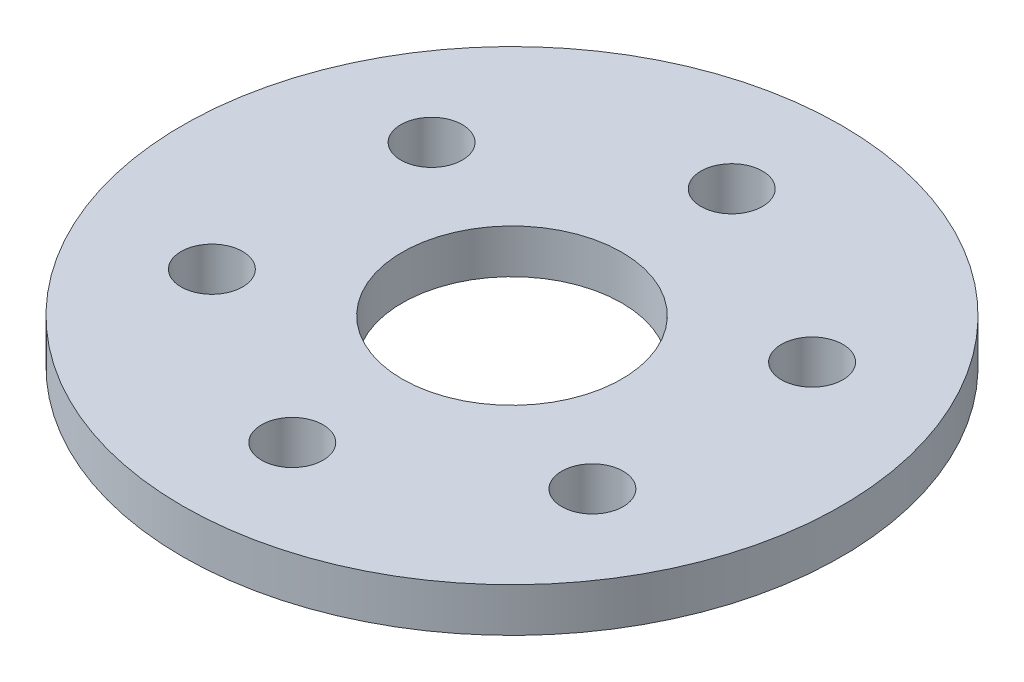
ISO-10303-21;
HEADER;
FILE_DESCRIPTION(('STEP AP214'),'2;1');
FILE_NAME('part.step','',(''),(''),'','','');
FILE_SCHEMA(('AUTOMOTIVE_DESIGN { 1 0 10303 214 1 1 1 1 }'));
ENDSEC;
DATA;
#1=APPLICATION_CONTEXT('core data for automotive mechanical design processes');
#2=APPLICATION_PROTOCOL_DEFINITION('international standard','automotive_design',2000,#1);
#3=PRODUCT_CONTEXT('',#1,'mechanical');
#4=PRODUCT('Part','Part','',(#3));
#5=PRODUCT_RELATED_PRODUCT_CATEGORY('part','',(#4));
#6=PRODUCT_DEFINITION_FORMATION('','',#4);
#7=PRODUCT_DEFINITION_CONTEXT('part definition',#1,'design');
#8=PRODUCT_DEFINITION('design','',#6,#7);
#9=PRODUCT_DEFINITION_SHAPE('','',#8);
#10=(LENGTH_UNIT() NAMED_UNIT(*) SI_UNIT(.MILLI.,.METRE.));
#11=(NAMED_UNIT(*) PLANE_ANGLE_UNIT() SI_UNIT($,.RADIAN.));
#12=(NAMED_UNIT(*) SI_UNIT($,.STERADIAN.) SOLID_ANGLE_UNIT());
#13=UNCERTAINTY_MEASURE_WITH_UNIT(LENGTH_MEASURE(1.E-05),#10,'distance_accuracy_value','');
#14=(GEOMETRIC_REPRESENTATION_CONTEXT(3) GLOBAL_UNCERTAINTY_ASSIGNED_CONTEXT((#13)) GLOBAL_UNIT_ASSIGNED_CONTEXT((#10,
#11,#12)) REPRESENTATION_CONTEXT('',''));
#15=CARTESIAN_POINT('',(0.,0.,0.));
#16=DIRECTION('',(0.,0.,1.));
#17=DIRECTION('',(1.,0.,0.));
#18=AXIS2_PLACEMENT_3D('',#15,#16,#17);
#19=CARTESIAN_POINT('',(0.,5.,0.));
#20=DIRECTION('',(0.,1.,0.));
#21=DIRECTION('',(0.,0.,1.));
#22=AXIS2_PLACEMENT_3D('',#19,#20,#21);
#23=PLANE('',#22);
#24=CARTESIAN_POINT('',(21.6506350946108,5.,12.5000000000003));
#25=DIRECTION('',(0.,1.,0.));
#26=DIRECTION('',(0.,0.,1.));
#27=AXIS2_PLACEMENT_3D('',#24,#25,#26);
#28=CIRCLE('',#27,3.5);
#29=CARTESIAN_POINT('',(21.6506350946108,5.,16.0000000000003));
#30=VERTEX_POINT('',#29);
#31=EDGE_CURVE('E84',#30,#30,#28,.T.);
#32=ORIENTED_EDGE('',*,*,#31,.F.);
#33=EDGE_LOOP('',(#32));
#34=FACE_BOUND('',#33,.T.);
#35=CARTESIAN_POINT('',(21.6506350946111,5.,-12.4999999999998));
#36=DIRECTION('',(0.,1.,0.));
#37=DIRECTION('',(0.,0.,1.));
#38=AXIS2_PLACEMENT_3D('',#35,#36,#37);
#39=CIRCLE('',#38,3.5);
#40=CARTESIAN_POINT('',(21.6506350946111,5.,-8.9999999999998));
#41=VERTEX_POINT('',#40);
#42=EDGE_CURVE('E78',#41,#41,#39,.T.);
#43=ORIENTED_EDGE('',*,*,#42,.F.);
#44=EDGE_LOOP('',(#43));
#45=FACE_BOUND('',#44,.T.);
#46=CARTESIAN_POINT('',(1.74574168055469E-13,5.,-25.));
#47=DIRECTION('',(0.,1.,0.));
#48=DIRECTION('',(0.,0.,1.));
#49=AXIS2_PLACEMENT_3D('',#46,#47,#48);
#50=CIRCLE('',#49,3.5);
#51=CARTESIAN_POINT('',(1.74574168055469E-13,5.,-21.5));
#52=VERTEX_POINT('',#51);
#53=EDGE_CURVE('E72',#52,#52,#50,.T.);
#54=ORIENTED_EDGE('',*,*,#53,.F.);
#55=EDGE_LOOP('',(#54));
#56=FACE_BOUND('',#55,.T.);
#57=CARTESIAN_POINT('',(-21.6506350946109,5.,-12.5000000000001));
#58=DIRECTION('',(0.,1.,0.));
#59=DIRECTION('',(0.,0.,1.));
#60=AXIS2_PLACEMENT_3D('',#57,#58,#59);
#61=CIRCLE('',#60,3.5);
#62=CARTESIAN_POINT('',(-21.6506350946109,5.,-9.0000000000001));
#63=VERTEX_POINT('',#62);
#64=EDGE_CURVE('E66',#63,#63,#61,.T.);
#65=ORIENTED_EDGE('',*,*,#64,.F.);
#66=EDGE_LOOP('',(#65));
#67=FACE_BOUND('',#66,.T.);
#68=CARTESIAN_POINT('',(-21.650635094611,5.,12.5));
#69=DIRECTION('',(0.,1.,0.));
#70=DIRECTION('',(0.,0.,1.));
#71=AXIS2_PLACEMENT_3D('',#68,#69,#70);
#72=CIRCLE('',#71,3.5);
#73=CARTESIAN_POINT('',(-21.650635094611,5.,16.));
#74=VERTEX_POINT('',#73);
#75=EDGE_CURVE('E60',#74,#74,#72,.T.);
#76=ORIENTED_EDGE('',*,*,#75,.F.);
#77=EDGE_LOOP('',(#76));
#78=FACE_BOUND('',#77,.T.);
#79=CARTESIAN_POINT('',(0.,5.,25.));
#80=DIRECTION('',(0.,1.,0.));
#81=DIRECTION('',(0.,0.,1.));
#82=AXIS2_PLACEMENT_3D('',#79,#80,#81);
#83=CIRCLE('',#82,3.5);
#84=CARTESIAN_POINT('',(0.,5.,28.5));
#85=VERTEX_POINT('',#84);
#86=EDGE_CURVE('E54',#85,#85,#83,.T.);
#87=ORIENTED_EDGE('',*,*,#86,.F.);
#88=EDGE_LOOP('',(#87));
#89=FACE_BOUND('',#88,.T.);
#90=CARTESIAN_POINT('',(0.,5.,0.));
#91=DIRECTION('',(0.,1.,0.));
#92=DIRECTION('',(0.,0.,1.));
#93=AXIS2_PLACEMENT_3D('',#90,#91,#92);
#94=CIRCLE('',#93,37.5);
#95=CARTESIAN_POINT('',(0.,5.,37.5));
#96=VERTEX_POINT('',#95);
#97=EDGE_CURVE('E10',#96,#96,#94,.T.);
#98=ORIENTED_EDGE('',*,*,#97,.T.);
#99=EDGE_LOOP('',(#98));
#100=FACE_BOUND('',#99,.T.);
#101=CARTESIAN_POINT('',(0.,5.,0.));
#102=DIRECTION('',(0.,1.,0.));
#103=DIRECTION('',(0.,0.,1.));
#104=AXIS2_PLACEMENT_3D('',#101,#102,#103);
#105=CIRCLE('',#104,12.5);
#106=CARTESIAN_POINT('',(0.,5.,12.5));
#107=VERTEX_POINT('',#106);
#108=EDGE_CURVE('E42',#107,#107,#105,.T.);
#109=ORIENTED_EDGE('',*,*,#108,.F.);
#110=EDGE_LOOP('',(#109));
#111=FACE_BOUND('',#110,.T.);
#112=ADVANCED_FACE('F31',(#34,#45,#56,#67,#78,#89,#100,#111),#23,.T.);
#113=CARTESIAN_POINT('',(0.,0.,0.));
#114=DIRECTION('',(0.,1.,0.));
#115=DIRECTION('',(0.,0.,1.));
#116=AXIS2_PLACEMENT_3D('',#113,#114,#115);
#117=PLANE('',#116);
#118=CARTESIAN_POINT('',(21.6506350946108,0.,12.5000000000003));
#119=DIRECTION('',(0.,1.,0.));
#120=DIRECTION('',(0.,0.,1.));
#121=AXIS2_PLACEMENT_3D('',#118,#119,#120);
#122=CIRCLE('',#121,3.5);
#123=CARTESIAN_POINT('',(21.6506350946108,0.,16.0000000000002));
#124=VERTEX_POINT('',#123);
#125=EDGE_CURVE('E81',#124,#124,#122,.T.);
#126=ORIENTED_EDGE('',*,*,#125,.T.);
#127=EDGE_LOOP('',(#126));
#128=FACE_BOUND('',#127,.T.);
#129=CARTESIAN_POINT('',(21.6506350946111,0.,-12.4999999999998));
#130=DIRECTION('',(0.,1.,0.));
#131=DIRECTION('',(0.,0.,1.));
#132=AXIS2_PLACEMENT_3D('',#129,#130,#131);
#133=CIRCLE('',#132,3.5);
#134=CARTESIAN_POINT('',(21.6506350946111,0.,-8.9999999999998));
#135=VERTEX_POINT('',#134);
#136=EDGE_CURVE('E75',#135,#135,#133,.T.);
#137=ORIENTED_EDGE('',*,*,#136,.T.);
#138=EDGE_LOOP('',(#137));
#139=FACE_BOUND('',#138,.T.);
#140=CARTESIAN_POINT('',(1.74574168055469E-13,0.,-25.));
#141=DIRECTION('',(0.,1.,0.));
#142=DIRECTION('',(0.,0.,1.));
#143=AXIS2_PLACEMENT_3D('',#140,#141,#142);
#144=CIRCLE('',#143,3.49999999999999);
#145=CARTESIAN_POINT('',(1.74574168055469E-13,0.,-21.5));
#146=VERTEX_POINT('',#145);
#147=EDGE_CURVE('E69',#146,#146,#144,.T.);
#148=ORIENTED_EDGE('',*,*,#147,.T.);
#149=EDGE_LOOP('',(#148));
#150=FACE_BOUND('',#149,.T.);
#151=CARTESIAN_POINT('',(-21.6506350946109,0.,-12.5000000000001));
#152=DIRECTION('',(0.,1.,0.));
#153=DIRECTION('',(0.,0.,1.));
#154=AXIS2_PLACEMENT_3D('',#151,#152,#153);
#155=CIRCLE('',#154,3.5);
#156=CARTESIAN_POINT('',(-21.6506350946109,0.,-9.00000000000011));
#157=VERTEX_POINT('',#156);
#158=EDGE_CURVE('E63',#157,#157,#155,.T.);
#159=ORIENTED_EDGE('',*,*,#158,.T.);
#160=EDGE_LOOP('',(#159));
#161=FACE_BOUND('',#160,.T.);
#162=CARTESIAN_POINT('',(-21.650635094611,0.,12.5));
#163=DIRECTION('',(0.,1.,0.));
#164=DIRECTION('',(0.,0.,1.));
#165=AXIS2_PLACEMENT_3D('',#162,#163,#164);
#166=CIRCLE('',#165,3.5);
#167=CARTESIAN_POINT('',(-21.650635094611,0.,15.9999999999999));
#168=VERTEX_POINT('',#167);
#169=EDGE_CURVE('E57',#168,#168,#166,.T.);
#170=ORIENTED_EDGE('',*,*,#169,.T.);
#171=EDGE_LOOP('',(#170));
#172=FACE_BOUND('',#171,.T.);
#173=CARTESIAN_POINT('',(0.,0.,25.));
#174=DIRECTION('',(0.,1.,0.));
#175=DIRECTION('',(0.,0.,1.));
#176=AXIS2_PLACEMENT_3D('',#173,#174,#175);
#177=CIRCLE('',#176,3.49999999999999);
#178=CARTESIAN_POINT('',(0.,0.,28.5));
#179=VERTEX_POINT('',#178);
#180=EDGE_CURVE('E51',#179,#179,#177,.T.);
#181=ORIENTED_EDGE('',*,*,#180,.T.);
#182=EDGE_LOOP('',(#181));
#183=FACE_BOUND('',#182,.T.);
#184=CARTESIAN_POINT('',(0.,0.,0.));
#185=DIRECTION('',(0.,1.,0.));
#186=DIRECTION('',(0.,0.,1.));
#187=AXIS2_PLACEMENT_3D('',#184,#185,#186);
#188=CIRCLE('',#187,37.5);
#189=CARTESIAN_POINT('',(0.,0.,37.5));
#190=VERTEX_POINT('',#189);
#191=EDGE_CURVE('E38',#190,#190,#188,.T.);
#192=ORIENTED_EDGE('',*,*,#191,.F.);
#193=EDGE_LOOP('',(#192));
#194=FACE_BOUND('',#193,.T.);
#195=CARTESIAN_POINT('',(0.,0.,0.));
#196=DIRECTION('',(0.,1.,0.));
#197=DIRECTION('',(0.,0.,1.));
#198=AXIS2_PLACEMENT_3D('',#195,#196,#197);
#199=CIRCLE('',#198,12.5);
#200=CARTESIAN_POINT('',(0.,0.,12.5));
#201=VERTEX_POINT('',#200);
#202=EDGE_CURVE('E46',#201,#201,#199,.T.);
#203=ORIENTED_EDGE('',*,*,#202,.T.);
#204=EDGE_LOOP('',(#203));
#205=FACE_BOUND('',#204,.T.);
#206=ADVANCED_FACE('F92',(#128,#139,#150,#161,#172,#183,#194,#205),#117,.F.);
#207=CARTESIAN_POINT('',(0.,5.,0.));
#208=DIRECTION('',(0.,-1.,0.));
#209=DIRECTION('',(0.,0.,-1.));
#210=AXIS2_PLACEMENT_3D('',#207,#208,#209);
#211=CYLINDRICAL_SURFACE('',#210,37.5);
#212=ORIENTED_EDGE('',*,*,#97,.F.);
#213=EDGE_LOOP('',(#212));
#214=FACE_BOUND('',#213,.T.);
#215=ORIENTED_EDGE('',*,*,#191,.T.);
#216=EDGE_LOOP('',(#215));
#217=FACE_BOUND('',#216,.T.);
#218=ADVANCED_FACE('F33',(#214,#217),#211,.T.);
#219=CARTESIAN_POINT('',(0.,5.,0.));
#220=DIRECTION('',(0.,-1.,0.));
#221=DIRECTION('',(0.,0.,-1.));
#222=AXIS2_PLACEMENT_3D('',#219,#220,#221);
#223=CYLINDRICAL_SURFACE('',#222,12.5);
#224=ORIENTED_EDGE('',*,*,#108,.T.);
#225=EDGE_LOOP('',(#224));
#226=FACE_BOUND('',#225,.T.);
#227=ORIENTED_EDGE('',*,*,#202,.F.);
#228=EDGE_LOOP('',(#227));
#229=FACE_BOUND('',#228,.T.);
#230=ADVANCED_FACE('F105',(#226,#229),#223,.F.);
#231=CARTESIAN_POINT('',(0.,5.,25.));
#232=DIRECTION('',(0.,1.,0.));
#233=DIRECTION('',(0.,0.,1.));
#234=AXIS2_PLACEMENT_3D('',#231,#232,#233);
#235=CYLINDRICAL_SURFACE('',#234,3.5);
#236=ORIENTED_EDGE('',*,*,#180,.F.);
#237=EDGE_LOOP('',(#236));
#238=FACE_BOUND('',#237,.T.);
#239=ORIENTED_EDGE('',*,*,#86,.T.);
#240=EDGE_LOOP('',(#239));
#241=FACE_BOUND('',#240,.T.);
#242=ADVANCED_FACE('F108',(#238,#241),#235,.F.);
#243=CARTESIAN_POINT('',(-21.650635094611,5.,12.5));
#244=DIRECTION('',(0.,1.,0.));
#245=DIRECTION('',(0.,0.,1.));
#246=AXIS2_PLACEMENT_3D('',#243,#244,#245);
#247=CYLINDRICAL_SURFACE('',#246,3.5);
#248=ORIENTED_EDGE('',*,*,#169,.F.);
#249=EDGE_LOOP('',(#248));
#250=FACE_BOUND('',#249,.T.);
#251=ORIENTED_EDGE('',*,*,#75,.T.);
#252=EDGE_LOOP('',(#251));
#253=FACE_BOUND('',#252,.T.);
#254=ADVANCED_FACE('F123',(#250,#253),#247,.F.);
#255=CARTESIAN_POINT('',(-21.6506350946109,5.,-12.5000000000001));
#256=DIRECTION('',(0.,1.,0.));
#257=DIRECTION('',(0.,0.,1.));
#258=AXIS2_PLACEMENT_3D('',#255,#256,#257);
#259=CYLINDRICAL_SURFACE('',#258,3.5);
#260=ORIENTED_EDGE('',*,*,#158,.F.);
#261=EDGE_LOOP('',(#260));
#262=FACE_BOUND('',#261,.T.);
#263=ORIENTED_EDGE('',*,*,#64,.T.);
#264=EDGE_LOOP('',(#263));
#265=FACE_BOUND('',#264,.T.);
#266=ADVANCED_FACE('F127',(#262,#265),#259,.F.);
#267=CARTESIAN_POINT('',(1.74574168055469E-13,5.,-25.));
#268=DIRECTION('',(0.,1.,0.));
#269=DIRECTION('',(0.,0.,1.));
#270=AXIS2_PLACEMENT_3D('',#267,#268,#269);
#271=CYLINDRICAL_SURFACE('',#270,3.5);
#272=ORIENTED_EDGE('',*,*,#147,.F.);
#273=EDGE_LOOP('',(#272));
#274=FACE_BOUND('',#273,.T.);
#275=ORIENTED_EDGE('',*,*,#53,.T.);
#276=EDGE_LOOP('',(#275));
#277=FACE_BOUND('',#276,.T.);
#278=ADVANCED_FACE('F131',(#274,#277),#271,.F.);
#279=CARTESIAN_POINT('',(21.6506350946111,5.,-12.4999999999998));
#280=DIRECTION('',(0.,1.,0.));
#281=DIRECTION('',(0.,0.,1.));
#282=AXIS2_PLACEMENT_3D('',#279,#280,#281);
#283=CYLINDRICAL_SURFACE('',#282,3.5);
#284=ORIENTED_EDGE('',*,*,#136,.F.);
#285=EDGE_LOOP('',(#284));
#286=FACE_BOUND('',#285,.T.);
#287=ORIENTED_EDGE('',*,*,#42,.T.);
#288=EDGE_LOOP('',(#287));
#289=FACE_BOUND('',#288,.T.);
#290=ADVANCED_FACE('F135',(#286,#289),#283,.F.);
#291=CARTESIAN_POINT('',(21.6506350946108,5.,12.5000000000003));
#292=DIRECTION('',(0.,1.,0.));
#293=DIRECTION('',(0.,0.,1.));
#294=AXIS2_PLACEMENT_3D('',#291,#292,#293);
#295=CYLINDRICAL_SURFACE('',#294,3.5);
#296=ORIENTED_EDGE('',*,*,#125,.F.);
#297=EDGE_LOOP('',(#296));
#298=FACE_BOUND('',#297,.T.);
#299=ORIENTED_EDGE('',*,*,#31,.T.);
#300=EDGE_LOOP('',(#299));
#301=FACE_BOUND('',#300,.T.);
#302=ADVANCED_FACE('F88',(#298,#301),#295,.F.);
#303=CLOSED_SHELL('',(#112,#206,#218,#230,#242,#254,#266,#278,#290,#302));
#304=MANIFOLD_SOLID_BREP('B2',#303);
#305=ADVANCED_BREP_SHAPE_REPRESENTATION('',(#18,#304),#14);
#306=SHAPE_DEFINITION_REPRESENTATION(#9,#305);
ENDSEC;
END-ISO-10303-21;
